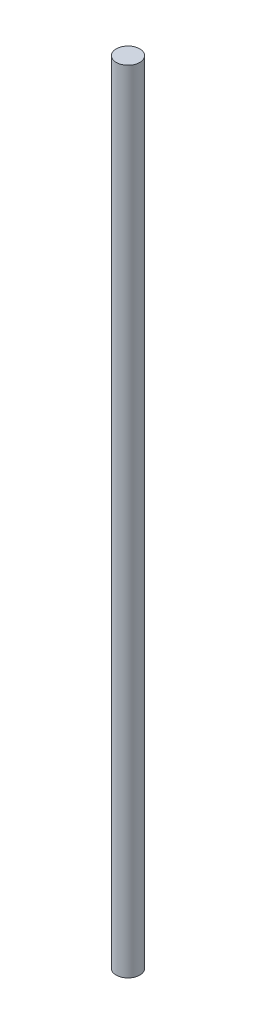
from build123d import *

# Parameters (mm, degrees)
CROQUIS1_R              = 5.95
SALIENTE_EXTRUIR1_DEPTH = 399


with BuildPart() as part:
    # Croquis1 → Saliente-Extruir1 (new body)
    with BuildSketch(Plane(origin=(0, 0, 0), x_dir=(1, 0, 0), z_dir=(0, 1, 0))):
        with Locations(Location((0, 0, 0), (0, 0, 270))):
            Circle(CROQUIS1_R)
    extrude(amount=SALIENTE_EXTRUIR1_DEPTH)


solid = part.part
